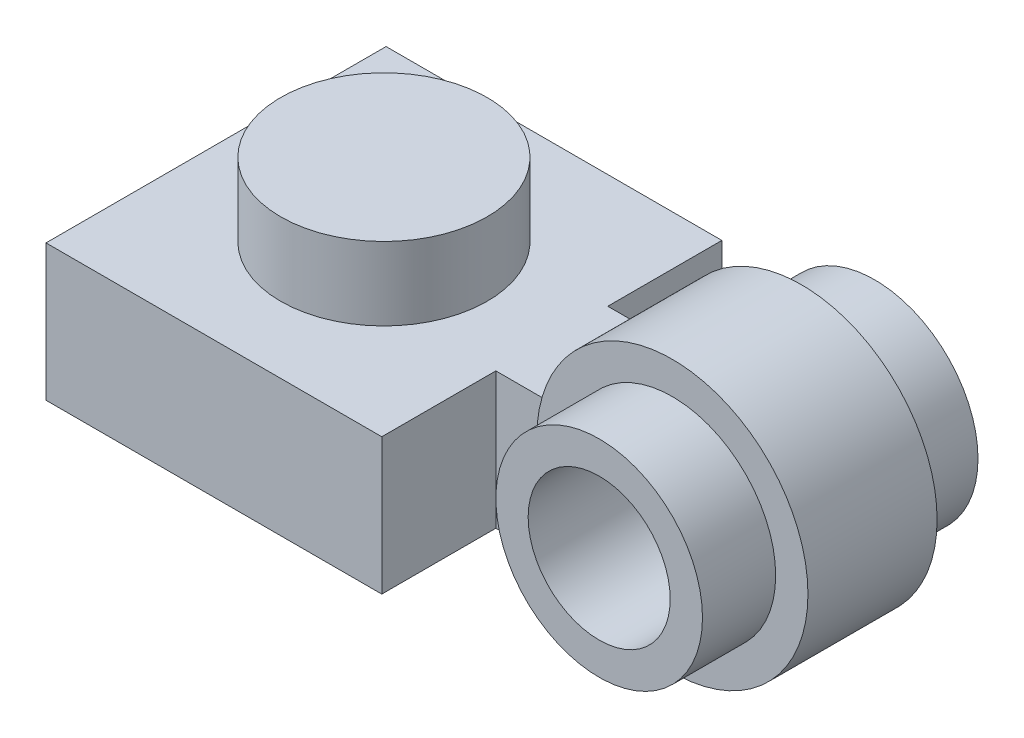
ISO-10303-21;
HEADER;
FILE_DESCRIPTION(('STEP AP214'),'2;1');
FILE_NAME('part.step','',(''),(''),'','','');
FILE_SCHEMA(('AUTOMOTIVE_DESIGN { 1 0 10303 214 1 1 1 1 }'));
ENDSEC;
DATA;
#1=APPLICATION_CONTEXT('core data for automotive mechanical design processes');
#2=APPLICATION_PROTOCOL_DEFINITION('international standard','automotive_design',2000,#1);
#3=PRODUCT_CONTEXT('',#1,'mechanical');
#4=PRODUCT('Part','Part','',(#3));
#5=PRODUCT_RELATED_PRODUCT_CATEGORY('part','',(#4));
#6=PRODUCT_DEFINITION_FORMATION('','',#4);
#7=PRODUCT_DEFINITION_CONTEXT('part definition',#1,'design');
#8=PRODUCT_DEFINITION('design','',#6,#7);
#9=PRODUCT_DEFINITION_SHAPE('','',#8);
#10=(LENGTH_UNIT() NAMED_UNIT(*) SI_UNIT(.MILLI.,.METRE.));
#11=(NAMED_UNIT(*) PLANE_ANGLE_UNIT() SI_UNIT($,.RADIAN.));
#12=(NAMED_UNIT(*) SI_UNIT($,.STERADIAN.) SOLID_ANGLE_UNIT());
#13=UNCERTAINTY_MEASURE_WITH_UNIT(LENGTH_MEASURE(1.E-05),#10,'distance_accuracy_value','');
#14=(GEOMETRIC_REPRESENTATION_CONTEXT(3) GLOBAL_UNCERTAINTY_ASSIGNED_CONTEXT((#13)) GLOBAL_UNIT_ASSIGNED_CONTEXT((#10,
#11,#12)) REPRESENTATION_CONTEXT('',''));
#15=CARTESIAN_POINT('',(0.,0.,0.));
#16=DIRECTION('',(0.,0.,1.));
#17=DIRECTION('',(1.,0.,0.));
#18=AXIS2_PLACEMENT_3D('',#15,#16,#17);
#19=CARTESIAN_POINT('',(8.2,2.5,-1.5));
#20=DIRECTION('',(0.,0.,1.));
#21=DIRECTION('',(1.,0.,0.));
#22=AXIS2_PLACEMENT_3D('',#19,#20,#21);
#23=PLANE('',#22);
#24=CARTESIAN_POINT('',(8.2,2.5,-1.5));
#25=DIRECTION('',(0.,0.,1.));
#26=DIRECTION('',(1.,0.,0.));
#27=AXIS2_PLACEMENT_3D('',#24,#25,#26);
#28=CIRCLE('',#27,3.15);
#29=CARTESIAN_POINT('',(11.35,2.5,-1.5));
#30=VERTEX_POINT('',#29);
#31=EDGE_CURVE('E506',#30,#30,#28,.T.);
#32=ORIENTED_EDGE('',*,*,#31,.F.);
#33=EDGE_LOOP('',(#32));
#34=FACE_BOUND('',#33,.T.);
#35=CARTESIAN_POINT('',(8.2,2.5,-1.5));
#36=DIRECTION('',(0.,0.,1.));
#37=DIRECTION('',(1.,0.,0.));
#38=AXIS2_PLACEMENT_3D('',#35,#36,#37);
#39=CIRCLE('',#38,2.4);
#40=CARTESIAN_POINT('',(10.6,2.5,-1.5));
#41=VERTEX_POINT('',#40);
#42=EDGE_CURVE('E11',#41,#41,#39,.F.);
#43=ORIENTED_EDGE('',*,*,#42,.F.);
#44=EDGE_LOOP('',(#43));
#45=FACE_BOUND('',#44,.T.);
#46=ADVANCED_FACE('F37',(#34,#45),#23,.F.);
#47=CARTESIAN_POINT('',(8.2,2.5,1.5));
#48=DIRECTION('',(0.,0.,1.));
#49=DIRECTION('',(1.,0.,0.));
#50=AXIS2_PLACEMENT_3D('',#47,#48,#49);
#51=PLANE('',#50);
#52=CARTESIAN_POINT('',(8.2,2.5,1.5));
#53=DIRECTION('',(0.,0.,1.));
#54=DIRECTION('',(1.,0.,0.));
#55=AXIS2_PLACEMENT_3D('',#52,#53,#54);
#56=CIRCLE('',#55,3.15);
#57=CARTESIAN_POINT('',(11.35,2.5,1.5));
#58=VERTEX_POINT('',#57);
#59=EDGE_CURVE('E509',#58,#58,#56,.T.);
#60=ORIENTED_EDGE('',*,*,#59,.T.);
#61=EDGE_LOOP('',(#60));
#62=FACE_BOUND('',#61,.T.);
#63=CARTESIAN_POINT('',(8.2,2.5,1.5));
#64=DIRECTION('',(0.,0.,1.));
#65=DIRECTION('',(1.,0.,0.));
#66=AXIS2_PLACEMENT_3D('',#63,#64,#65);
#67=CIRCLE('',#66,2.4);
#68=CARTESIAN_POINT('',(10.6,2.5,1.5));
#69=VERTEX_POINT('',#68);
#70=EDGE_CURVE('E502',#69,#69,#67,.T.);
#71=ORIENTED_EDGE('',*,*,#70,.F.);
#72=EDGE_LOOP('',(#71));
#73=FACE_BOUND('',#72,.T.);
#74=ADVANCED_FACE('F275',(#62,#73),#51,.T.);
#75=CARTESIAN_POINT('',(-3.9,3.166,-3.95));
#76=DIRECTION('',(0.,1.,0.));
#77=DIRECTION('',(0.,0.,1.));
#78=AXIS2_PLACEMENT_3D('',#75,#76,#77);
#79=PLANE('',#78);
#80=CARTESIAN_POINT('',(0.,3.166,0.));
#81=DIRECTION('',(0.,1.,0.));
#82=DIRECTION('',(0.,0.,1.));
#83=AXIS2_PLACEMENT_3D('',#80,#81,#82);
#84=CIRCLE('',#83,2.4);
#85=CARTESIAN_POINT('',(0.,3.166,2.4));
#86=VERTEX_POINT('',#85);
#87=EDGE_CURVE('E199',#86,#86,#84,.T.);
#88=ORIENTED_EDGE('',*,*,#87,.F.);
#89=EDGE_LOOP('',(#88));
#90=FACE_BOUND('',#89,.T.);
#91=DIRECTION('',(-1.,0.,0.));
#92=VECTOR('',#91,1.);
#93=CARTESIAN_POINT('',(10.7,3.166,1.3));
#94=LINE('',#93,#92);
#95=CARTESIAN_POINT('',(5.12121062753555,3.166,1.3));
#96=VERTEX_POINT('',#95);
#97=CARTESIAN_POINT('',(3.9,3.166,1.3));
#98=VERTEX_POINT('',#97);
#99=EDGE_CURVE('E135',#96,#98,#94,.T.);
#100=ORIENTED_EDGE('',*,*,#99,.F.);
#101=DIRECTION('',(0.,0.,-1.));
#102=VECTOR('',#101,1.);
#103=CARTESIAN_POINT('',(5.12121062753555,3.166,1.5));
#104=LINE('',#103,#102);
#105=CARTESIAN_POINT('',(5.12121062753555,3.166,-1.3));
#106=VERTEX_POINT('',#105);
#107=EDGE_CURVE('E138',#96,#106,#104,.T.);
#108=ORIENTED_EDGE('',*,*,#107,.T.);
#109=DIRECTION('',(-1.,0.,0.));
#110=VECTOR('',#109,1.);
#111=CARTESIAN_POINT('',(10.7,3.166,-1.3));
#112=LINE('',#111,#110);
#113=CARTESIAN_POINT('',(3.9,3.166,-1.3));
#114=VERTEX_POINT('',#113);
#115=EDGE_CURVE('E126',#106,#114,#112,.T.);
#116=ORIENTED_EDGE('',*,*,#115,.T.);
#117=DIRECTION('',(0.,0.,-1.));
#118=VECTOR('',#117,1.);
#119=CARTESIAN_POINT('',(3.9,3.166,3.95));
#120=LINE('',#119,#118);
#121=CARTESIAN_POINT('',(3.9,3.166,-3.95));
#122=VERTEX_POINT('',#121);
#123=EDGE_CURVE('E166',#114,#122,#120,.T.);
#124=ORIENTED_EDGE('',*,*,#123,.T.);
#125=DIRECTION('',(-1.,0.,0.));
#126=VECTOR('',#125,1.);
#127=CARTESIAN_POINT('',(3.9,3.166,-3.95));
#128=LINE('',#127,#126);
#129=CARTESIAN_POINT('',(-3.9,3.166,-3.95));
#130=VERTEX_POINT('',#129);
#131=EDGE_CURVE('E219',#122,#130,#128,.T.);
#132=ORIENTED_EDGE('',*,*,#131,.T.);
#133=DIRECTION('',(0.,0.,1.));
#134=VECTOR('',#133,1.);
#135=CARTESIAN_POINT('',(-3.9,3.166,3.95));
#136=LINE('',#135,#134);
#137=CARTESIAN_POINT('',(-3.9,3.166,3.95));
#138=VERTEX_POINT('',#137);
#139=EDGE_CURVE('E212',#130,#138,#136,.T.);
#140=ORIENTED_EDGE('',*,*,#139,.T.);
#141=DIRECTION('',(1.,0.,0.));
#142=VECTOR('',#141,1.);
#143=CARTESIAN_POINT('',(3.9,3.166,3.95));
#144=LINE('',#143,#142);
#145=CARTESIAN_POINT('',(3.9,3.166,3.95));
#146=VERTEX_POINT('',#145);
#147=EDGE_CURVE('E215',#138,#146,#144,.T.);
#148=ORIENTED_EDGE('',*,*,#147,.T.);
#149=EDGE_CURVE('E222',#146,#98,#120,.T.);
#150=ORIENTED_EDGE('',*,*,#149,.T.);
#151=EDGE_LOOP('',(#100,#108,#116,#124,#132,#140,#148,#150));
#152=FACE_BOUND('',#151,.T.);
#153=ADVANCED_FACE('F139',(#90,#152),#79,.T.);
#154=CARTESIAN_POINT('',(-3.9,0.,-3.95));
#155=DIRECTION('',(0.,1.,0.));
#156=DIRECTION('',(0.,0.,1.));
#157=AXIS2_PLACEMENT_3D('',#154,#155,#156);
#158=PLANE('',#157);
#159=DIRECTION('',(1.,0.,0.));
#160=VECTOR('',#159,1.);
#161=CARTESIAN_POINT('',(2.45,0.,-2.5));
#162=LINE('',#161,#160);
#163=CARTESIAN_POINT('',(-2.45,0.,-2.5));
#164=VERTEX_POINT('',#163);
#165=CARTESIAN_POINT('',(2.45,0.,-2.5));
#166=VERTEX_POINT('',#165);
#167=EDGE_CURVE('E189',#164,#166,#162,.T.);
#168=ORIENTED_EDGE('',*,*,#167,.F.);
#169=DIRECTION('',(0.,0.,-1.));
#170=VECTOR('',#169,1.);
#171=CARTESIAN_POINT('',(-2.45,0.,-2.5));
#172=LINE('',#171,#170);
#173=CARTESIAN_POINT('',(-2.45,0.,2.5));
#174=VERTEX_POINT('',#173);
#175=EDGE_CURVE('E187',#174,#164,#172,.T.);
#176=ORIENTED_EDGE('',*,*,#175,.F.);
#177=DIRECTION('',(-1.,0.,0.));
#178=VECTOR('',#177,1.);
#179=CARTESIAN_POINT('',(2.45,0.,2.5));
#180=LINE('',#179,#178);
#181=CARTESIAN_POINT('',(2.45,0.,2.5));
#182=VERTEX_POINT('',#181);
#183=EDGE_CURVE('E177',#182,#174,#180,.T.);
#184=ORIENTED_EDGE('',*,*,#183,.F.);
#185=DIRECTION('',(0.,0.,1.));
#186=VECTOR('',#185,1.);
#187=CARTESIAN_POINT('',(2.45,0.,-2.5));
#188=LINE('',#187,#186);
#189=EDGE_CURVE('E192',#166,#182,#188,.T.);
#190=ORIENTED_EDGE('',*,*,#189,.F.);
#191=EDGE_LOOP('',(#168,#176,#184,#190));
#192=FACE_BOUND('',#191,.T.);
#193=DIRECTION('',(0.,0.,-1.));
#194=VECTOR('',#193,1.);
#195=CARTESIAN_POINT('',(6.28362321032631,0.,1.5));
#196=LINE('',#195,#194);
#197=CARTESIAN_POINT('',(6.28362321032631,0.,1.3));
#198=VERTEX_POINT('',#197);
#199=CARTESIAN_POINT('',(6.28362321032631,0.,-1.3));
#200=VERTEX_POINT('',#199);
#201=EDGE_CURVE('E52',#198,#200,#196,.T.);
#202=ORIENTED_EDGE('',*,*,#201,.F.);
#203=DIRECTION('',(-1.,0.,0.));
#204=VECTOR('',#203,1.);
#205=CARTESIAN_POINT('',(10.7,0.,1.3));
#206=LINE('',#205,#204);
#207=CARTESIAN_POINT('',(3.9,0.,1.3));
#208=VERTEX_POINT('',#207);
#209=EDGE_CURVE('E153',#198,#208,#206,.T.);
#210=ORIENTED_EDGE('',*,*,#209,.T.);
#211=DIRECTION('',(0.,0.,-1.));
#212=VECTOR('',#211,1.);
#213=CARTESIAN_POINT('',(3.9,0.,3.95));
#214=LINE('',#213,#212);
#215=CARTESIAN_POINT('',(3.9,0.,3.95));
#216=VERTEX_POINT('',#215);
#217=EDGE_CURVE('E227',#216,#208,#214,.T.);
#218=ORIENTED_EDGE('',*,*,#217,.F.);
#219=DIRECTION('',(1.,0.,0.));
#220=VECTOR('',#219,1.);
#221=CARTESIAN_POINT('',(3.9,0.,3.95));
#222=LINE('',#221,#220);
#223=CARTESIAN_POINT('',(-3.9,0.,3.95));
#224=VERTEX_POINT('',#223);
#225=EDGE_CURVE('E228',#224,#216,#222,.T.);
#226=ORIENTED_EDGE('',*,*,#225,.F.);
#227=DIRECTION('',(0.,0.,1.));
#228=VECTOR('',#227,1.);
#229=CARTESIAN_POINT('',(-3.9,0.,3.95));
#230=LINE('',#229,#228);
#231=CARTESIAN_POINT('',(-3.9,0.,-3.95));
#232=VERTEX_POINT('',#231);
#233=EDGE_CURVE('E209',#232,#224,#230,.T.);
#234=ORIENTED_EDGE('',*,*,#233,.F.);
#235=DIRECTION('',(-1.,0.,0.));
#236=VECTOR('',#235,1.);
#237=CARTESIAN_POINT('',(3.9,0.,-3.95));
#238=LINE('',#237,#236);
#239=CARTESIAN_POINT('',(3.9,0.,-3.95));
#240=VERTEX_POINT('',#239);
#241=EDGE_CURVE('E216',#240,#232,#238,.T.);
#242=ORIENTED_EDGE('',*,*,#241,.F.);
#243=CARTESIAN_POINT('',(3.9,0.,-1.3));
#244=VERTEX_POINT('',#243);
#245=EDGE_CURVE('E224',#244,#240,#214,.T.);
#246=ORIENTED_EDGE('',*,*,#245,.F.);
#247=DIRECTION('',(-1.,0.,0.));
#248=VECTOR('',#247,1.);
#249=CARTESIAN_POINT('',(10.7,0.,-1.3));
#250=LINE('',#249,#248);
#251=EDGE_CURVE('E134',#200,#244,#250,.T.);
#252=ORIENTED_EDGE('',*,*,#251,.F.);
#253=EDGE_LOOP('',(#202,#210,#218,#226,#234,#242,#246,#252));
#254=FACE_BOUND('',#253,.T.);
#255=ADVANCED_FACE('F250',(#192,#254),#158,.F.);
#256=CARTESIAN_POINT('',(10.7,0.,1.3));
#257=DIRECTION('',(0.,0.,-1.));
#258=DIRECTION('',(-1.,0.,0.));
#259=AXIS2_PLACEMENT_3D('',#256,#257,#258);
#260=PLANE('',#259);
#261=CARTESIAN_POINT('',(8.2,2.5,1.3));
#262=DIRECTION('',(0.,0.,-1.));
#263=DIRECTION('',(-1.,0.,0.));
#264=AXIS2_PLACEMENT_3D('',#261,#262,#263);
#265=CIRCLE('',#264,3.15);
#266=EDGE_CURVE('E59',#96,#198,#265,.F.);
#267=ORIENTED_EDGE('',*,*,#266,.F.);
#268=ORIENTED_EDGE('',*,*,#99,.T.);
#269=DIRECTION('',(0.,-1.,0.));
#270=VECTOR('',#269,1.);
#271=CARTESIAN_POINT('',(3.9,0.,1.3));
#272=LINE('',#271,#270);
#273=EDGE_CURVE('E157',#98,#208,#272,.T.);
#274=ORIENTED_EDGE('',*,*,#273,.T.);
#275=ORIENTED_EDGE('',*,*,#209,.F.);
#276=EDGE_LOOP('',(#267,#268,#274,#275));
#277=FACE_BOUND('',#276,.T.);
#278=ADVANCED_FACE('F294',(#277),#260,.F.);
#279=CARTESIAN_POINT('',(10.7,3.166,-1.3));
#280=DIRECTION('',(0.,0.,1.));
#281=DIRECTION('',(0.,-1.,0.));
#282=AXIS2_PLACEMENT_3D('',#279,#280,#281);
#283=PLANE('',#282);
#284=CARTESIAN_POINT('',(8.2,2.5,-1.3));
#285=DIRECTION('',(0.,0.,1.));
#286=DIRECTION('',(0.,-1.,0.));
#287=AXIS2_PLACEMENT_3D('',#284,#285,#286);
#288=CIRCLE('',#287,3.15);
#289=EDGE_CURVE('E45',#200,#106,#288,.F.);
#290=ORIENTED_EDGE('',*,*,#289,.F.);
#291=ORIENTED_EDGE('',*,*,#251,.T.);
#292=DIRECTION('',(0.,1.,0.));
#293=VECTOR('',#292,1.);
#294=CARTESIAN_POINT('',(3.9,3.166,-1.3));
#295=LINE('',#294,#293);
#296=EDGE_CURVE('E131',#244,#114,#295,.T.);
#297=ORIENTED_EDGE('',*,*,#296,.T.);
#298=ORIENTED_EDGE('',*,*,#115,.F.);
#299=EDGE_LOOP('',(#290,#291,#297,#298));
#300=FACE_BOUND('',#299,.T.);
#301=ADVANCED_FACE('F128',(#300),#283,.F.);
#302=CARTESIAN_POINT('',(3.9,3.166,3.95));
#303=DIRECTION('',(-1.,0.,0.));
#304=DIRECTION('',(0.,0.,1.));
#305=AXIS2_PLACEMENT_3D('',#302,#303,#304);
#306=PLANE('',#305);
#307=ORIENTED_EDGE('',*,*,#273,.F.);
#308=ORIENTED_EDGE('',*,*,#149,.F.);
#309=DIRECTION('',(0.,-1.,0.));
#310=VECTOR('',#309,1.);
#311=CARTESIAN_POINT('',(3.9,3.166,3.95));
#312=LINE('',#311,#310);
#313=EDGE_CURVE('E147',#146,#216,#312,.T.);
#314=ORIENTED_EDGE('',*,*,#313,.T.);
#315=ORIENTED_EDGE('',*,*,#217,.T.);
#316=EDGE_LOOP('',(#307,#308,#314,#315));
#317=FACE_BOUND('',#316,.T.);
#318=ADVANCED_FACE('F247',(#317),#306,.F.);
#319=ORIENTED_EDGE('',*,*,#296,.F.);
#320=ORIENTED_EDGE('',*,*,#245,.T.);
#321=DIRECTION('',(0.,-1.,0.));
#322=VECTOR('',#321,1.);
#323=CARTESIAN_POINT('',(3.9,3.166,-3.95));
#324=LINE('',#323,#322);
#325=EDGE_CURVE('E237',#122,#240,#324,.T.);
#326=ORIENTED_EDGE('',*,*,#325,.F.);
#327=ORIENTED_EDGE('',*,*,#123,.F.);
#328=EDGE_LOOP('',(#319,#320,#326,#327));
#329=FACE_BOUND('',#328,.T.);
#330=ADVANCED_FACE('F254',(#329),#306,.F.);
#331=CARTESIAN_POINT('',(-3.9,3.166,3.95));
#332=DIRECTION('',(1.,0.,0.));
#333=DIRECTION('',(0.,0.,-1.));
#334=AXIS2_PLACEMENT_3D('',#331,#332,#333);
#335=PLANE('',#334);
#336=ORIENTED_EDGE('',*,*,#233,.T.);
#337=DIRECTION('',(0.,-1.,0.));
#338=VECTOR('',#337,1.);
#339=CARTESIAN_POINT('',(-3.9,3.166,3.95));
#340=LINE('',#339,#338);
#341=EDGE_CURVE('E144',#138,#224,#340,.T.);
#342=ORIENTED_EDGE('',*,*,#341,.F.);
#343=ORIENTED_EDGE('',*,*,#139,.F.);
#344=DIRECTION('',(0.,-1.,0.));
#345=VECTOR('',#344,1.);
#346=CARTESIAN_POINT('',(-3.9,3.166,-3.95));
#347=LINE('',#346,#345);
#348=EDGE_CURVE('E234',#130,#232,#347,.T.);
#349=ORIENTED_EDGE('',*,*,#348,.T.);
#350=EDGE_LOOP('',(#336,#342,#343,#349));
#351=FACE_BOUND('',#350,.T.);
#352=ADVANCED_FACE('F39',(#351),#335,.F.);
#353=CARTESIAN_POINT('',(3.9,3.166,3.95));
#354=DIRECTION('',(0.,0.,-1.));
#355=DIRECTION('',(-1.,0.,0.));
#356=AXIS2_PLACEMENT_3D('',#353,#354,#355);
#357=PLANE('',#356);
#358=ORIENTED_EDGE('',*,*,#225,.T.);
#359=ORIENTED_EDGE('',*,*,#313,.F.);
#360=ORIENTED_EDGE('',*,*,#147,.F.);
#361=ORIENTED_EDGE('',*,*,#341,.T.);
#362=EDGE_LOOP('',(#358,#359,#360,#361));
#363=FACE_BOUND('',#362,.T.);
#364=ADVANCED_FACE('F265',(#363),#357,.F.);
#365=CARTESIAN_POINT('',(3.9,3.166,-3.95));
#366=DIRECTION('',(0.,0.,1.));
#367=DIRECTION('',(1.,0.,0.));
#368=AXIS2_PLACEMENT_3D('',#365,#366,#367);
#369=PLANE('',#368);
#370=ORIENTED_EDGE('',*,*,#241,.T.);
#371=ORIENTED_EDGE('',*,*,#348,.F.);
#372=ORIENTED_EDGE('',*,*,#131,.F.);
#373=ORIENTED_EDGE('',*,*,#325,.T.);
#374=EDGE_LOOP('',(#370,#371,#372,#373));
#375=FACE_BOUND('',#374,.T.);
#376=ADVANCED_FACE('F260',(#375),#369,.F.);
#377=CARTESIAN_POINT('',(0.,4.866,0.));
#378=DIRECTION('',(0.,-1.,0.));
#379=DIRECTION('',(0.,0.,-1.));
#380=AXIS2_PLACEMENT_3D('',#377,#378,#379);
#381=CYLINDRICAL_SURFACE('',#380,2.4);
#382=CARTESIAN_POINT('',(0.,4.866,0.));
#383=DIRECTION('',(0.,1.,0.));
#384=DIRECTION('',(0.,0.,1.));
#385=AXIS2_PLACEMENT_3D('',#382,#383,#384);
#386=CIRCLE('',#385,2.4);
#387=CARTESIAN_POINT('',(0.,4.866,2.4));
#388=VERTEX_POINT('',#387);
#389=EDGE_CURVE('E206',#388,#388,#386,.T.);
#390=ORIENTED_EDGE('',*,*,#389,.F.);
#391=EDGE_LOOP('',(#390));
#392=FACE_BOUND('',#391,.T.);
#393=ORIENTED_EDGE('',*,*,#87,.T.);
#394=EDGE_LOOP('',(#393));
#395=FACE_BOUND('',#394,.T.);
#396=ADVANCED_FACE('F271',(#392,#395),#381,.T.);
#397=CARTESIAN_POINT('',(0.,4.866,0.));
#398=DIRECTION('',(0.,1.,0.));
#399=DIRECTION('',(0.,0.,1.));
#400=AXIS2_PLACEMENT_3D('',#397,#398,#399);
#401=PLANE('',#400);
#402=ORIENTED_EDGE('',*,*,#389,.T.);
#403=EDGE_LOOP('',(#402));
#404=FACE_BOUND('',#403,.T.);
#405=ADVANCED_FACE('F315',(#404),#401,.T.);
#406=CARTESIAN_POINT('',(-2.45,2.5,-2.5));
#407=DIRECTION('',(-1.,0.,0.));
#408=DIRECTION('',(0.,0.,1.));
#409=AXIS2_PLACEMENT_3D('',#406,#407,#408);
#410=PLANE('',#409);
#411=ORIENTED_EDGE('',*,*,#175,.T.);
#412=DIRECTION('',(0.,-1.,0.));
#413=VECTOR('',#412,1.);
#414=CARTESIAN_POINT('',(-2.45,2.5,-2.5));
#415=LINE('',#414,#413);
#416=CARTESIAN_POINT('',(-2.45,2.5,-2.5));
#417=VERTEX_POINT('',#416);
#418=EDGE_CURVE('E186',#417,#164,#415,.T.);
#419=ORIENTED_EDGE('',*,*,#418,.F.);
#420=DIRECTION('',(0.,0.,-1.));
#421=VECTOR('',#420,1.);
#422=CARTESIAN_POINT('',(-2.45,2.5,-2.5));
#423=LINE('',#422,#421);
#424=CARTESIAN_POINT('',(-2.45,2.5,2.5));
#425=VERTEX_POINT('',#424);
#426=EDGE_CURVE('E173',#425,#417,#423,.T.);
#427=ORIENTED_EDGE('',*,*,#426,.F.);
#428=DIRECTION('',(0.,-1.,0.));
#429=VECTOR('',#428,1.);
#430=CARTESIAN_POINT('',(-2.45,2.5,2.5));
#431=LINE('',#430,#429);
#432=EDGE_CURVE('E197',#425,#174,#431,.T.);
#433=ORIENTED_EDGE('',*,*,#432,.T.);
#434=EDGE_LOOP('',(#411,#419,#427,#433));
#435=FACE_BOUND('',#434,.T.);
#436=ADVANCED_FACE('F305',(#435),#410,.F.);
#437=CARTESIAN_POINT('',(2.45,2.5,2.5));
#438=DIRECTION('',(0.,0.,1.));
#439=DIRECTION('',(1.,0.,0.));
#440=AXIS2_PLACEMENT_3D('',#437,#438,#439);
#441=PLANE('',#440);
#442=ORIENTED_EDGE('',*,*,#183,.T.);
#443=ORIENTED_EDGE('',*,*,#432,.F.);
#444=DIRECTION('',(-1.,0.,0.));
#445=VECTOR('',#444,1.);
#446=CARTESIAN_POINT('',(2.45,2.5,2.5));
#447=LINE('',#446,#445);
#448=CARTESIAN_POINT('',(2.45,2.5,2.5));
#449=VERTEX_POINT('',#448);
#450=EDGE_CURVE('E183',#449,#425,#447,.T.);
#451=ORIENTED_EDGE('',*,*,#450,.F.);
#452=DIRECTION('',(0.,-1.,0.));
#453=VECTOR('',#452,1.);
#454=CARTESIAN_POINT('',(2.45,2.5,2.5));
#455=LINE('',#454,#453);
#456=EDGE_CURVE('E200',#449,#182,#455,.T.);
#457=ORIENTED_EDGE('',*,*,#456,.T.);
#458=EDGE_LOOP('',(#442,#443,#451,#457));
#459=FACE_BOUND('',#458,.T.);
#460=ADVANCED_FACE('F301',(#459),#441,.F.);
#461=CARTESIAN_POINT('',(2.45,2.5,-2.5));
#462=DIRECTION('',(1.,0.,0.));
#463=DIRECTION('',(0.,0.,-1.));
#464=AXIS2_PLACEMENT_3D('',#461,#462,#463);
#465=PLANE('',#464);
#466=ORIENTED_EDGE('',*,*,#189,.T.);
#467=ORIENTED_EDGE('',*,*,#456,.F.);
#468=DIRECTION('',(0.,0.,1.));
#469=VECTOR('',#468,1.);
#470=CARTESIAN_POINT('',(2.45,2.5,-2.5));
#471=LINE('',#470,#469);
#472=CARTESIAN_POINT('',(2.45,2.5,-2.5));
#473=VERTEX_POINT('',#472);
#474=EDGE_CURVE('E180',#473,#449,#471,.T.);
#475=ORIENTED_EDGE('',*,*,#474,.F.);
#476=DIRECTION('',(0.,-1.,0.));
#477=VECTOR('',#476,1.);
#478=CARTESIAN_POINT('',(2.45,2.5,-2.5));
#479=LINE('',#478,#477);
#480=EDGE_CURVE('E202',#473,#166,#479,.T.);
#481=ORIENTED_EDGE('',*,*,#480,.T.);
#482=EDGE_LOOP('',(#466,#467,#475,#481));
#483=FACE_BOUND('',#482,.T.);
#484=ADVANCED_FACE('F304',(#483),#465,.F.);
#485=CARTESIAN_POINT('',(2.45,2.5,-2.5));
#486=DIRECTION('',(0.,0.,-1.));
#487=DIRECTION('',(-1.,0.,0.));
#488=AXIS2_PLACEMENT_3D('',#485,#486,#487);
#489=PLANE('',#488);
#490=ORIENTED_EDGE('',*,*,#167,.T.);
#491=ORIENTED_EDGE('',*,*,#480,.F.);
#492=DIRECTION('',(1.,0.,0.));
#493=VECTOR('',#492,1.);
#494=CARTESIAN_POINT('',(2.45,2.5,-2.5));
#495=LINE('',#494,#493);
#496=EDGE_CURVE('E176',#417,#473,#495,.T.);
#497=ORIENTED_EDGE('',*,*,#496,.F.);
#498=ORIENTED_EDGE('',*,*,#418,.T.);
#499=EDGE_LOOP('',(#490,#491,#497,#498));
#500=FACE_BOUND('',#499,.T.);
#501=ADVANCED_FACE('F299',(#500),#489,.F.);
#502=CARTESIAN_POINT('',(-2.45,2.5,2.5));
#503=DIRECTION('',(0.,-1.,0.));
#504=DIRECTION('',(0.,0.,-1.));
#505=AXIS2_PLACEMENT_3D('',#502,#503,#504);
#506=PLANE('',#505);
#507=ORIENTED_EDGE('',*,*,#426,.T.);
#508=ORIENTED_EDGE('',*,*,#496,.T.);
#509=ORIENTED_EDGE('',*,*,#474,.T.);
#510=ORIENTED_EDGE('',*,*,#450,.T.);
#511=EDGE_LOOP('',(#507,#508,#509,#510));
#512=FACE_BOUND('',#511,.T.);
#513=ADVANCED_FACE('F290',(#512),#506,.T.);
#514=CARTESIAN_POINT('',(8.2,2.5,1.5));
#515=DIRECTION('',(0.,0.,-1.));
#516=DIRECTION('',(-1.,0.,0.));
#517=AXIS2_PLACEMENT_3D('',#514,#515,#516);
#518=CYLINDRICAL_SURFACE('',#517,3.15);
#519=ORIENTED_EDGE('',*,*,#31,.T.);
#520=EDGE_LOOP('',(#519));
#521=FACE_BOUND('',#520,.T.);
#522=ORIENTED_EDGE('',*,*,#59,.F.);
#523=EDGE_LOOP('',(#522));
#524=FACE_BOUND('',#523,.T.);
#525=ORIENTED_EDGE('',*,*,#107,.F.);
#526=ORIENTED_EDGE('',*,*,#266,.T.);
#527=ORIENTED_EDGE('',*,*,#201,.T.);
#528=ORIENTED_EDGE('',*,*,#289,.T.);
#529=EDGE_LOOP('',(#525,#526,#527,#528));
#530=FACE_BOUND('',#529,.T.);
#531=ADVANCED_FACE('F143',(#521,#524,#530),#518,.T.);
#532=CARTESIAN_POINT('',(8.2,2.5,3.2));
#533=DIRECTION('',(0.,0.,-1.));
#534=DIRECTION('',(-1.,0.,0.));
#535=AXIS2_PLACEMENT_3D('',#532,#533,#534);
#536=CYLINDRICAL_SURFACE('',#535,2.4);
#537=CARTESIAN_POINT('',(8.2,2.5,3.2));
#538=DIRECTION('',(0.,0.,1.));
#539=DIRECTION('',(1.,0.,0.));
#540=AXIS2_PLACEMENT_3D('',#537,#538,#539);
#541=CIRCLE('',#540,2.4);
#542=CARTESIAN_POINT('',(10.6,2.5,3.2));
#543=VERTEX_POINT('',#542);
#544=EDGE_CURVE('E503',#543,#543,#541,.T.);
#545=ORIENTED_EDGE('',*,*,#544,.F.);
#546=EDGE_LOOP('',(#545));
#547=FACE_BOUND('',#546,.T.);
#548=ORIENTED_EDGE('',*,*,#70,.T.);
#549=EDGE_LOOP('',(#548));
#550=FACE_BOUND('',#549,.T.);
#551=ADVANCED_FACE('F289',(#547,#550),#536,.T.);
#552=CARTESIAN_POINT('',(8.2,2.5,3.2));
#553=DIRECTION('',(0.,0.,1.));
#554=DIRECTION('',(1.,0.,0.));
#555=AXIS2_PLACEMENT_3D('',#552,#553,#554);
#556=PLANE('',#555);
#557=CARTESIAN_POINT('',(8.2,2.5,3.2));
#558=DIRECTION('',(0.,0.,1.));
#559=DIRECTION('',(1.,0.,0.));
#560=AXIS2_PLACEMENT_3D('',#557,#558,#559);
#561=CIRCLE('',#560,1.65);
#562=CARTESIAN_POINT('',(9.85,2.5,3.2));
#563=VERTEX_POINT('',#562);
#564=EDGE_CURVE('E492',#563,#563,#561,.T.);
#565=ORIENTED_EDGE('',*,*,#564,.F.);
#566=EDGE_LOOP('',(#565));
#567=FACE_BOUND('',#566,.T.);
#568=ORIENTED_EDGE('',*,*,#544,.T.);
#569=EDGE_LOOP('',(#568));
#570=FACE_BOUND('',#569,.T.);
#571=ADVANCED_FACE('F442',(#567,#570),#556,.T.);
#572=CARTESIAN_POINT('',(8.2,2.5,-3.2));
#573=DIRECTION('',(0.,0.,1.));
#574=DIRECTION('',(1.,0.,0.));
#575=AXIS2_PLACEMENT_3D('',#572,#573,#574);
#576=CYLINDRICAL_SURFACE('',#575,2.4);
#577=CARTESIAN_POINT('',(8.2,2.5,-3.2));
#578=DIRECTION('',(0.,0.,-1.));
#579=DIRECTION('',(-1.,0.,0.));
#580=AXIS2_PLACEMENT_3D('',#577,#578,#579);
#581=CIRCLE('',#580,2.4);
#582=CARTESIAN_POINT('',(5.8,2.5,-3.2));
#583=VERTEX_POINT('',#582);
#584=EDGE_CURVE('E497',#583,#583,#581,.T.);
#585=ORIENTED_EDGE('',*,*,#584,.F.);
#586=EDGE_LOOP('',(#585));
#587=FACE_BOUND('',#586,.T.);
#588=ORIENTED_EDGE('',*,*,#42,.T.);
#589=EDGE_LOOP('',(#588));
#590=FACE_BOUND('',#589,.T.);
#591=ADVANCED_FACE('F450',(#587,#590),#576,.T.);
#592=CARTESIAN_POINT('',(8.2,2.5,-3.2));
#593=DIRECTION('',(0.,0.,-1.));
#594=DIRECTION('',(-1.,0.,0.));
#595=AXIS2_PLACEMENT_3D('',#592,#593,#594);
#596=PLANE('',#595);
#597=CARTESIAN_POINT('',(8.2,2.5,-3.2));
#598=DIRECTION('',(0.,0.,-1.));
#599=DIRECTION('',(-1.,0.,0.));
#600=AXIS2_PLACEMENT_3D('',#597,#598,#599);
#601=CIRCLE('',#600,1.65);
#602=CARTESIAN_POINT('',(6.55,2.5,-3.2));
#603=VERTEX_POINT('',#602);
#604=EDGE_CURVE('E495',#603,#603,#601,.T.);
#605=ORIENTED_EDGE('',*,*,#604,.F.);
#606=EDGE_LOOP('',(#605));
#607=FACE_BOUND('',#606,.T.);
#608=ORIENTED_EDGE('',*,*,#584,.T.);
#609=EDGE_LOOP('',(#608));
#610=FACE_BOUND('',#609,.T.);
#611=ADVANCED_FACE('F464',(#607,#610),#596,.T.);
#612=CARTESIAN_POINT('',(8.2,2.5,3.950025));
#613=DIRECTION('',(0.,0.,-1.));
#614=DIRECTION('',(-1.,0.,0.));
#615=AXIS2_PLACEMENT_3D('',#612,#613,#614);
#616=CYLINDRICAL_SURFACE('',#615,1.65);
#617=ORIENTED_EDGE('',*,*,#564,.T.);
#618=EDGE_LOOP('',(#617));
#619=FACE_BOUND('',#618,.T.);
#620=ORIENTED_EDGE('',*,*,#604,.T.);
#621=EDGE_LOOP('',(#620));
#622=FACE_BOUND('',#621,.T.);
#623=ADVANCED_FACE('F472',(#619,#622),#616,.F.);
#624=CLOSED_SHELL('',(#46,#74,#153,#255,#278,#301,#318,#330,#352,#364,#376,#396,#405,#436,#460,
#484,#501,#513,#531,#551,#571,#591,#611,#623));
#625=MANIFOLD_SOLID_BREP('B2',#624);
#626=ADVANCED_BREP_SHAPE_REPRESENTATION('',(#18,#625),#14);
#627=SHAPE_DEFINITION_REPRESENTATION(#9,#626);
ENDSEC;
END-ISO-10303-21;
